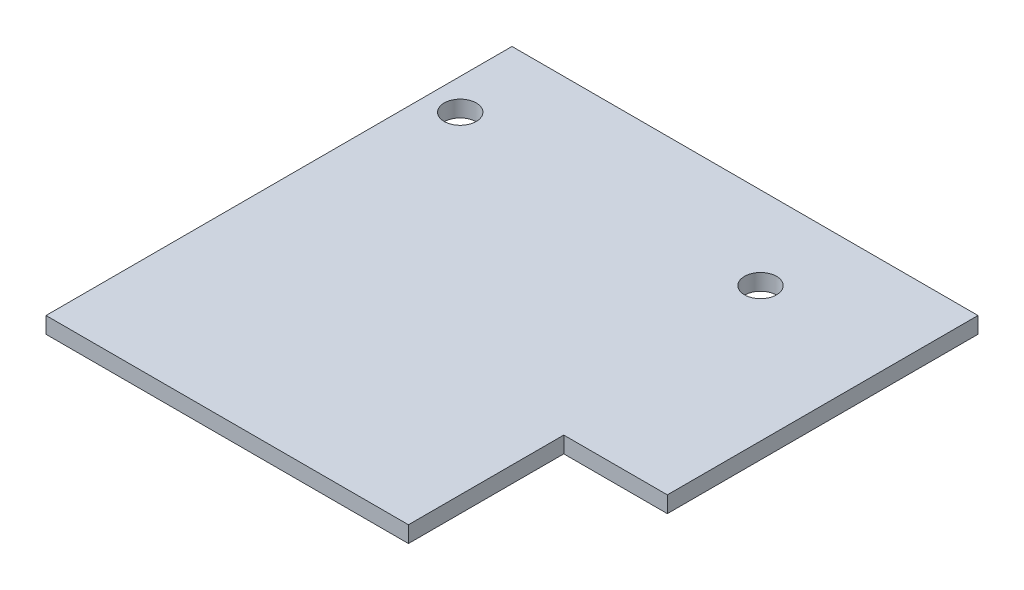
ISO-10303-21;
HEADER;
FILE_DESCRIPTION(('STEP AP214'),'2;1');
FILE_NAME('part.step','',(''),(''),'','','');
FILE_SCHEMA(('AUTOMOTIVE_DESIGN { 1 0 10303 214 1 1 1 1 }'));
ENDSEC;
DATA;
#1=APPLICATION_CONTEXT('core data for automotive mechanical design processes');
#2=APPLICATION_PROTOCOL_DEFINITION('international standard','automotive_design',2000,#1);
#3=PRODUCT_CONTEXT('',#1,'mechanical');
#4=PRODUCT('Part','Part','',(#3));
#5=PRODUCT_RELATED_PRODUCT_CATEGORY('part','',(#4));
#6=PRODUCT_DEFINITION_FORMATION('','',#4);
#7=PRODUCT_DEFINITION_CONTEXT('part definition',#1,'design');
#8=PRODUCT_DEFINITION('design','',#6,#7);
#9=PRODUCT_DEFINITION_SHAPE('','',#8);
#10=(LENGTH_UNIT() NAMED_UNIT(*) SI_UNIT(.MILLI.,.METRE.));
#11=(NAMED_UNIT(*) PLANE_ANGLE_UNIT() SI_UNIT($,.RADIAN.));
#12=(NAMED_UNIT(*) SI_UNIT($,.STERADIAN.) SOLID_ANGLE_UNIT());
#13=UNCERTAINTY_MEASURE_WITH_UNIT(LENGTH_MEASURE(1.E-05),#10,'distance_accuracy_value','');
#14=(GEOMETRIC_REPRESENTATION_CONTEXT(3) GLOBAL_UNCERTAINTY_ASSIGNED_CONTEXT((#13)) GLOBAL_UNIT_ASSIGNED_CONTEXT((#10,
#11,#12)) REPRESENTATION_CONTEXT('',''));
#15=CARTESIAN_POINT('',(0.,0.,0.));
#16=DIRECTION('',(0.,0.,1.));
#17=DIRECTION('',(1.,0.,0.));
#18=AXIS2_PLACEMENT_3D('',#15,#16,#17);
#19=CARTESIAN_POINT('',(17.5,0.,0.));
#20=DIRECTION('',(-1.,0.,0.));
#21=DIRECTION('',(0.,0.,1.));
#22=AXIS2_PLACEMENT_3D('',#19,#20,#21);
#23=PLANE('',#22);
#24=DIRECTION('',(0.,-1.,0.));
#25=VECTOR('',#24,1.);
#26=CARTESIAN_POINT('',(17.5,0.,-15.));
#27=LINE('',#26,#25);
#28=CARTESIAN_POINT('',(17.5,1.5748,-15.));
#29=VERTEX_POINT('',#28);
#30=CARTESIAN_POINT('',(17.5,0.,-15.));
#31=VERTEX_POINT('',#30);
#32=EDGE_CURVE('E49',#29,#31,#27,.T.);
#33=ORIENTED_EDGE('',*,*,#32,.F.);
#34=DIRECTION('',(0.,0.,1.));
#35=VECTOR('',#34,1.);
#36=CARTESIAN_POINT('',(17.5,1.5748,0.));
#37=LINE('',#36,#35);
#38=CARTESIAN_POINT('',(17.5,1.5748,0.));
#39=VERTEX_POINT('',#38);
#40=EDGE_CURVE('E54',#29,#39,#37,.T.);
#41=ORIENTED_EDGE('',*,*,#40,.T.);
#42=DIRECTION('',(0.,-1.,0.));
#43=VECTOR('',#42,1.);
#44=CARTESIAN_POINT('',(17.5,0.,0.));
#45=LINE('',#44,#43);
#46=CARTESIAN_POINT('',(17.5,0.,0.));
#47=VERTEX_POINT('',#46);
#48=EDGE_CURVE('E85',#39,#47,#45,.T.);
#49=ORIENTED_EDGE('',*,*,#48,.T.);
#50=DIRECTION('',(0.,0.,-1.));
#51=VECTOR('',#50,1.);
#52=CARTESIAN_POINT('',(17.5,0.,0.));
#53=LINE('',#52,#51);
#54=EDGE_CURVE('E109',#47,#31,#53,.T.);
#55=ORIENTED_EDGE('',*,*,#54,.T.);
#56=EDGE_LOOP('',(#33,#41,#49,#55));
#57=FACE_BOUND('',#56,.T.);
#58=ADVANCED_FACE('F32',(#57),#23,.F.);
#59=CARTESIAN_POINT('',(17.5,0.,0.));
#60=DIRECTION('',(0.,0.,-1.));
#61=DIRECTION('',(-1.,0.,0.));
#62=AXIS2_PLACEMENT_3D('',#59,#60,#61);
#63=PLANE('',#62);
#64=DIRECTION('',(0.,-1.,0.));
#65=VECTOR('',#64,1.);
#66=CARTESIAN_POINT('',(-17.5,0.,0.));
#67=LINE('',#66,#65);
#68=CARTESIAN_POINT('',(-17.5,1.5748,0.));
#69=VERTEX_POINT('',#68);
#70=CARTESIAN_POINT('',(-17.5,0.,0.));
#71=VERTEX_POINT('',#70);
#72=EDGE_CURVE('E91',#69,#71,#67,.T.);
#73=ORIENTED_EDGE('',*,*,#72,.T.);
#74=DIRECTION('',(-1.,0.,0.));
#75=VECTOR('',#74,1.);
#76=CARTESIAN_POINT('',(17.5,0.,0.));
#77=LINE('',#76,#75);
#78=EDGE_CURVE('E11',#47,#71,#77,.T.);
#79=ORIENTED_EDGE('',*,*,#78,.F.);
#80=ORIENTED_EDGE('',*,*,#48,.F.);
#81=DIRECTION('',(-1.,0.,0.));
#82=VECTOR('',#81,1.);
#83=CARTESIAN_POINT('',(17.5,1.5748,0.));
#84=LINE('',#83,#82);
#85=EDGE_CURVE('E77',#39,#69,#84,.T.);
#86=ORIENTED_EDGE('',*,*,#85,.T.);
#87=EDGE_LOOP('',(#73,#79,#80,#86));
#88=FACE_BOUND('',#87,.T.);
#89=ADVANCED_FACE('F34',(#88),#63,.F.);
#90=CARTESIAN_POINT('',(17.5,0.,0.));
#91=DIRECTION('',(0.,1.,0.));
#92=DIRECTION('',(0.,0.,1.));
#93=AXIS2_PLACEMENT_3D('',#90,#91,#92);
#94=PLANE('',#93);
#95=CARTESIAN_POINT('',(-14.5,0.,-37.));
#96=DIRECTION('',(0.,1.,0.));
#97=DIRECTION('',(0.,0.,1.));
#98=AXIS2_PLACEMENT_3D('',#95,#96,#97);
#99=CIRCLE('',#98,1.55);
#100=CARTESIAN_POINT('',(-14.5,0.,-35.45));
#101=VERTEX_POINT('',#100);
#102=EDGE_CURVE('E117',#101,#101,#99,.T.);
#103=ORIENTED_EDGE('',*,*,#102,.T.);
#104=EDGE_LOOP('',(#103));
#105=FACE_BOUND('',#104,.T.);
#106=CARTESIAN_POINT('',(14.5,0.,-37.));
#107=DIRECTION('',(0.,1.,0.));
#108=DIRECTION('',(0.,0.,1.));
#109=AXIS2_PLACEMENT_3D('',#106,#107,#108);
#110=CIRCLE('',#109,1.55);
#111=CARTESIAN_POINT('',(14.5,0.,-35.45));
#112=VERTEX_POINT('',#111);
#113=EDGE_CURVE('E95',#112,#112,#110,.T.);
#114=ORIENTED_EDGE('',*,*,#113,.T.);
#115=EDGE_LOOP('',(#114));
#116=FACE_BOUND('',#115,.T.);
#117=DIRECTION('',(0.,0.,-1.));
#118=VECTOR('',#117,1.);
#119=CARTESIAN_POINT('',(-17.5,0.,0.));
#120=LINE('',#119,#118);
#121=CARTESIAN_POINT('',(-17.5,0.,-45.));
#122=VERTEX_POINT('',#121);
#123=EDGE_CURVE('E94',#71,#122,#120,.T.);
#124=ORIENTED_EDGE('',*,*,#123,.T.);
#125=DIRECTION('',(-1.,0.,0.));
#126=VECTOR('',#125,1.);
#127=CARTESIAN_POINT('',(17.5,0.,-45.));
#128=LINE('',#127,#126);
#129=CARTESIAN_POINT('',(27.5,0.,-45.));
#130=VERTEX_POINT('',#129);
#131=EDGE_CURVE('E41',#130,#122,#128,.T.);
#132=ORIENTED_EDGE('',*,*,#131,.F.);
#133=DIRECTION('',(0.,0.,-1.));
#134=VECTOR('',#133,1.);
#135=CARTESIAN_POINT('',(27.5,0.,-45.));
#136=LINE('',#135,#134);
#137=CARTESIAN_POINT('',(27.5,0.,-15.));
#138=VERTEX_POINT('',#137);
#139=EDGE_CURVE('E126',#138,#130,#136,.T.);
#140=ORIENTED_EDGE('',*,*,#139,.F.);
#141=DIRECTION('',(-1.,0.,0.));
#142=VECTOR('',#141,1.);
#143=CARTESIAN_POINT('',(27.5,0.,-15.));
#144=LINE('',#143,#142);
#145=EDGE_CURVE('E130',#138,#31,#144,.T.);
#146=ORIENTED_EDGE('',*,*,#145,.T.);
#147=ORIENTED_EDGE('',*,*,#54,.F.);
#148=ORIENTED_EDGE('',*,*,#78,.T.);
#149=EDGE_LOOP('',(#124,#132,#140,#146,#147,#148));
#150=FACE_BOUND('',#149,.T.);
#151=ADVANCED_FACE('F156',(#105,#116,#150),#94,.F.);
#152=CARTESIAN_POINT('',(17.5,0.,-45.));
#153=DIRECTION('',(0.,0.,1.));
#154=DIRECTION('',(1.,0.,0.));
#155=AXIS2_PLACEMENT_3D('',#152,#153,#154);
#156=PLANE('',#155);
#157=DIRECTION('',(0.,1.,0.));
#158=VECTOR('',#157,1.);
#159=CARTESIAN_POINT('',(-17.5,0.,-45.));
#160=LINE('',#159,#158);
#161=CARTESIAN_POINT('',(-17.5,1.5748,-45.));
#162=VERTEX_POINT('',#161);
#163=EDGE_CURVE('E86',#122,#162,#160,.T.);
#164=ORIENTED_EDGE('',*,*,#163,.T.);
#165=DIRECTION('',(-1.,0.,0.));
#166=VECTOR('',#165,1.);
#167=CARTESIAN_POINT('',(17.5,1.5748,-45.));
#168=LINE('',#167,#166);
#169=CARTESIAN_POINT('',(27.5,1.5748,-45.));
#170=VERTEX_POINT('',#169);
#171=EDGE_CURVE('E81',#170,#162,#168,.T.);
#172=ORIENTED_EDGE('',*,*,#171,.F.);
#173=DIRECTION('',(0.,1.,0.));
#174=VECTOR('',#173,1.);
#175=CARTESIAN_POINT('',(27.5,0.,-45.));
#176=LINE('',#175,#174);
#177=EDGE_CURVE('E129',#130,#170,#176,.T.);
#178=ORIENTED_EDGE('',*,*,#177,.F.);
#179=ORIENTED_EDGE('',*,*,#131,.T.);
#180=EDGE_LOOP('',(#164,#172,#178,#179));
#181=FACE_BOUND('',#180,.T.);
#182=ADVANCED_FACE('F164',(#181),#156,.F.);
#183=CARTESIAN_POINT('',(17.5,1.5748,0.));
#184=DIRECTION('',(0.,-1.,0.));
#185=DIRECTION('',(0.,0.,-1.));
#186=AXIS2_PLACEMENT_3D('',#183,#184,#185);
#187=PLANE('',#186);
#188=CARTESIAN_POINT('',(-14.5,1.5748,-37.));
#189=DIRECTION('',(0.,1.,0.));
#190=DIRECTION('',(0.,0.,1.));
#191=AXIS2_PLACEMENT_3D('',#188,#189,#190);
#192=CIRCLE('',#191,1.54999999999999);
#193=CARTESIAN_POINT('',(-14.5,1.5748,-35.45));
#194=VERTEX_POINT('',#193);
#195=EDGE_CURVE('E120',#194,#194,#192,.T.);
#196=ORIENTED_EDGE('',*,*,#195,.F.);
#197=EDGE_LOOP('',(#196));
#198=FACE_BOUND('',#197,.T.);
#199=CARTESIAN_POINT('',(14.5,1.5748,-37.));
#200=DIRECTION('',(0.,1.,0.));
#201=DIRECTION('',(0.,0.,1.));
#202=AXIS2_PLACEMENT_3D('',#199,#200,#201);
#203=CIRCLE('',#202,1.54999999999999);
#204=CARTESIAN_POINT('',(14.5,1.5748,-35.45));
#205=VERTEX_POINT('',#204);
#206=EDGE_CURVE('E99',#205,#205,#203,.T.);
#207=ORIENTED_EDGE('',*,*,#206,.F.);
#208=EDGE_LOOP('',(#207));
#209=FACE_BOUND('',#208,.T.);
#210=DIRECTION('',(0.,0.,1.));
#211=VECTOR('',#210,1.);
#212=CARTESIAN_POINT('',(-17.5,1.5748,0.));
#213=LINE('',#212,#211);
#214=EDGE_CURVE('E74',#162,#69,#213,.T.);
#215=ORIENTED_EDGE('',*,*,#214,.T.);
#216=ORIENTED_EDGE('',*,*,#85,.F.);
#217=ORIENTED_EDGE('',*,*,#40,.F.);
#218=DIRECTION('',(-1.,0.,0.));
#219=VECTOR('',#218,1.);
#220=CARTESIAN_POINT('',(27.5,1.5748,-15.));
#221=LINE('',#220,#219);
#222=CARTESIAN_POINT('',(27.5,1.5748,-15.));
#223=VERTEX_POINT('',#222);
#224=EDGE_CURVE('E123',#223,#29,#221,.T.);
#225=ORIENTED_EDGE('',*,*,#224,.F.);
#226=DIRECTION('',(0.,0.,1.));
#227=VECTOR('',#226,1.);
#228=CARTESIAN_POINT('',(27.5,1.5748,-45.));
#229=LINE('',#228,#227);
#230=EDGE_CURVE('E146',#170,#223,#229,.T.);
#231=ORIENTED_EDGE('',*,*,#230,.F.);
#232=ORIENTED_EDGE('',*,*,#171,.T.);
#233=EDGE_LOOP('',(#215,#216,#217,#225,#231,#232));
#234=FACE_BOUND('',#233,.T.);
#235=ADVANCED_FACE('F76',(#198,#209,#234),#187,.F.);
#236=CARTESIAN_POINT('',(-17.5,0.,0.));
#237=DIRECTION('',(-1.,0.,0.));
#238=DIRECTION('',(0.,0.,1.));
#239=AXIS2_PLACEMENT_3D('',#236,#237,#238);
#240=PLANE('',#239);
#241=ORIENTED_EDGE('',*,*,#72,.F.);
#242=ORIENTED_EDGE('',*,*,#214,.F.);
#243=ORIENTED_EDGE('',*,*,#163,.F.);
#244=ORIENTED_EDGE('',*,*,#123,.F.);
#245=EDGE_LOOP('',(#241,#242,#243,#244));
#246=FACE_BOUND('',#245,.T.);
#247=ADVANCED_FACE('F93',(#246),#240,.T.);
#248=CARTESIAN_POINT('',(14.5,1.5748,-37.));
#249=DIRECTION('',(0.,1.,0.));
#250=DIRECTION('',(0.,0.,1.));
#251=AXIS2_PLACEMENT_3D('',#248,#249,#250);
#252=CYLINDRICAL_SURFACE('',#251,1.54999999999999);
#253=ORIENTED_EDGE('',*,*,#113,.F.);
#254=EDGE_LOOP('',(#253));
#255=FACE_BOUND('',#254,.T.);
#256=ORIENTED_EDGE('',*,*,#206,.T.);
#257=EDGE_LOOP('',(#256));
#258=FACE_BOUND('',#257,.T.);
#259=ADVANCED_FACE('F181',(#255,#258),#252,.F.);
#260=CARTESIAN_POINT('',(-14.5,1.5748,-37.));
#261=DIRECTION('',(0.,1.,0.));
#262=DIRECTION('',(0.,0.,1.));
#263=AXIS2_PLACEMENT_3D('',#260,#261,#262);
#264=CYLINDRICAL_SURFACE('',#263,1.54999999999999);
#265=ORIENTED_EDGE('',*,*,#102,.F.);
#266=EDGE_LOOP('',(#265));
#267=FACE_BOUND('',#266,.T.);
#268=ORIENTED_EDGE('',*,*,#195,.T.);
#269=EDGE_LOOP('',(#268));
#270=FACE_BOUND('',#269,.T.);
#271=ADVANCED_FACE('F187',(#267,#270),#264,.F.);
#272=CARTESIAN_POINT('',(27.5,0.,-15.));
#273=DIRECTION('',(0.,0.,-1.));
#274=DIRECTION('',(-1.,0.,0.));
#275=AXIS2_PLACEMENT_3D('',#272,#273,#274);
#276=PLANE('',#275);
#277=ORIENTED_EDGE('',*,*,#32,.T.);
#278=ORIENTED_EDGE('',*,*,#145,.F.);
#279=DIRECTION('',(0.,-1.,0.));
#280=VECTOR('',#279,1.);
#281=CARTESIAN_POINT('',(27.5,0.,-15.));
#282=LINE('',#281,#280);
#283=EDGE_CURVE('E143',#223,#138,#282,.T.);
#284=ORIENTED_EDGE('',*,*,#283,.F.);
#285=ORIENTED_EDGE('',*,*,#224,.T.);
#286=EDGE_LOOP('',(#277,#278,#284,#285));
#287=FACE_BOUND('',#286,.T.);
#288=ADVANCED_FACE('F138',(#287),#276,.F.);
#289=CARTESIAN_POINT('',(27.5,0.,0.));
#290=DIRECTION('',(1.,0.,0.));
#291=DIRECTION('',(0.,0.,-1.));
#292=AXIS2_PLACEMENT_3D('',#289,#290,#291);
#293=PLANE('',#292);
#294=ORIENTED_EDGE('',*,*,#177,.T.);
#295=ORIENTED_EDGE('',*,*,#230,.T.);
#296=ORIENTED_EDGE('',*,*,#283,.T.);
#297=ORIENTED_EDGE('',*,*,#139,.T.);
#298=EDGE_LOOP('',(#294,#295,#296,#297));
#299=FACE_BOUND('',#298,.T.);
#300=ADVANCED_FACE('F162',(#299),#293,.T.);
#301=CLOSED_SHELL('',(#58,#89,#151,#182,#235,#247,#259,#271,#288,#300));
#302=MANIFOLD_SOLID_BREP('B2',#301);
#303=ADVANCED_BREP_SHAPE_REPRESENTATION('',(#18,#302),#14);
#304=SHAPE_DEFINITION_REPRESENTATION(#9,#303);
ENDSEC;
END-ISO-10303-21;
